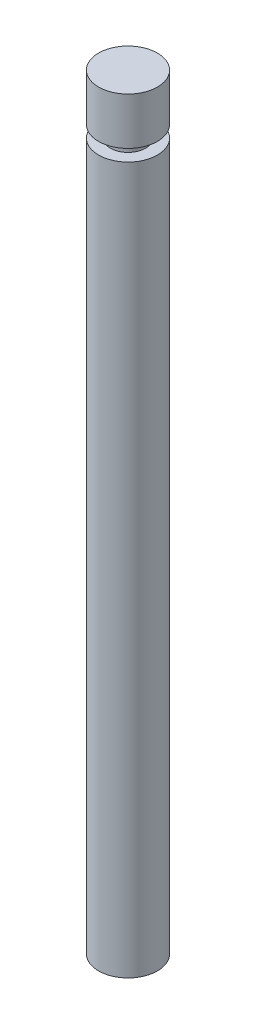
from build123d import *

# Parameters (mm, degrees)
SKETCH1_R      = 1.5875
EXTRUDE1_DEPTH = 38.1
SKETCH2_R      = 0.9525
EXTRUDE2_DEPTH = 0.635
SKETCH3_R      = 1.5875
EXTRUDE3_DEPTH = 2.54


with BuildPart() as part:
    # Sketch1 → Extrude1 (new body)
    with BuildSketch(Plane(origin=(0, 0, 0), x_dir=(1, 0, 0), z_dir=(0, 1, 0))):
        with Locations(Location((0, 0, 0), (0, 0, 90))):
            Circle(SKETCH1_R)
    extrude(amount=EXTRUDE1_DEPTH)

    # Sketch2 → Extrude2 (add)
    with BuildSketch(Plane(origin=(0, 38.1, 0), x_dir=(1, 0, 0), z_dir=(0, 1, 0))):
        with Locations(Location((0, 0, 0), (0, 0, 270))):
            Circle(SKETCH2_R)
    extrude(amount=EXTRUDE2_DEPTH)

    # Sketch3 → Extrude3 (add)
    with BuildSketch(Plane(origin=(0, 38.735, 0), x_dir=(1, 0, 0), z_dir=(0, 1, 0))):
        with Locations(Location((0, 0, 0), (0, 0, 90))):
            Circle(SKETCH3_R)
    extrude(amount=EXTRUDE3_DEPTH)


solid = part.part
